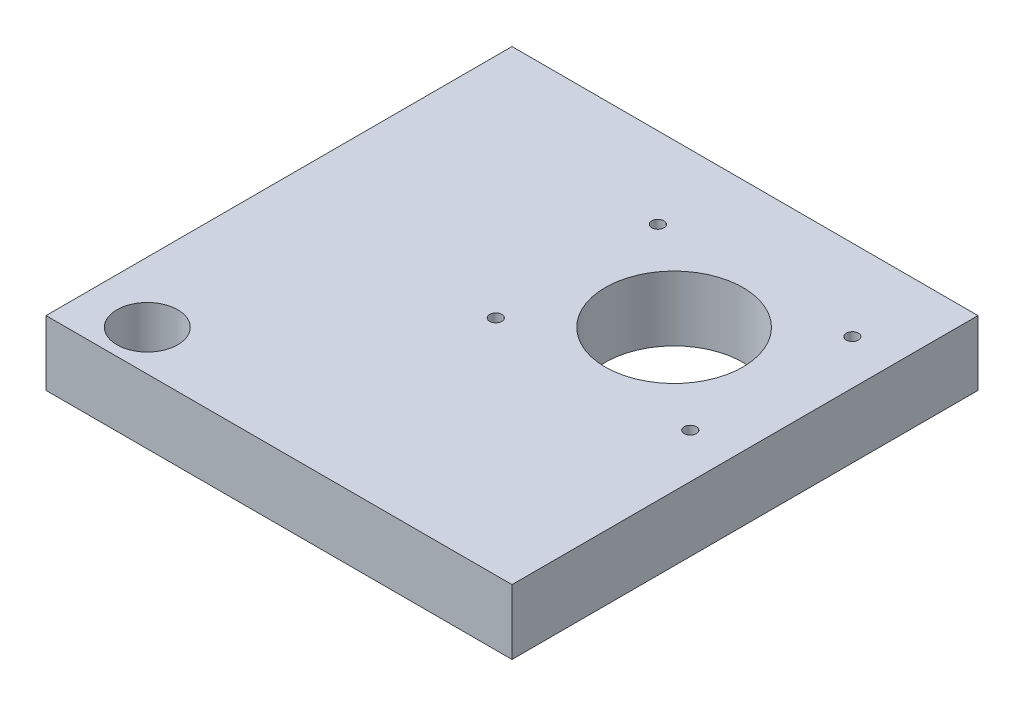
from build123d import *

# Parameters (mm, degrees)
ESQUISSE1_W             = 115
ESQUISSE1_H             = 16
BASE_EXTRUSION_DEPTH    = 115
ESQUISSE2_R             = 17
ENL_V_MAT_EXTRU_1_DEPTH = 164.419705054
ESQUISSE3_R             = 1.5
ENL_V_MAT_EXTRU_2_DEPTH = 164.419705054
ESQUISSE4_R             = 7.5
ENL_V_MAT_EXTRU_3_DEPTH = 164.419705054


with BuildPart() as part:
    # Esquisse1 → Base-Extrusion (new body)
    with BuildSketch(Plane.XY):
        with Locations((57.5, 8)):
            Rectangle(ESQUISSE1_W, ESQUISSE1_H)
    extrude(amount=BASE_EXTRUSION_DEPTH)

    # Esquisse2 → Enl_v. mat.-Extru.1 (cut, through all)
    with BuildSketch(Plane(origin=(0, 16, 0), x_dir=(-1, 0, 0), z_dir=(0, 1, 0))):
        with Locations(Location((-80, 40, 0), (0, 0, 90))):
            Circle(ESQUISSE2_R)
    extrude(amount=-ENL_V_MAT_EXTRU_1_DEPTH, mode=Mode.SUBTRACT)

    # Esquisse3 → Enl_v. mat.-Extru.2 (cut, through all)
    with BuildSketch(Plane(origin=(0, 16, 0), x_dir=(-1, 0, 0), z_dir=(0, 1, 0))):
        with Locations(Location((-104, 20, 0), (0, 0, 90))):
            Circle(ESQUISSE3_R)
        with Locations(Location((-104, 60, 0), (0, 0, 90))):
            Circle(ESQUISSE3_R)
        with Locations(Location((-56, 60, 0), (0, 0, 90))):
            Circle(ESQUISSE3_R)
        with Locations(Location((-56, 20, 0), (0, 0, 90))):
            Circle(ESQUISSE3_R)
    extrude(amount=-ENL_V_MAT_EXTRU_2_DEPTH, mode=Mode.SUBTRACT)

    # Esquisse4 → Enl_v. mat.-Extru.3 (cut, through all)
    with BuildSketch(Plane(origin=(0, 16, 0), x_dir=(-1, 0, 0), z_dir=(0, 1, 0))):
        with Locations(Location((-15, 105, 0), (0, 0, 90))):
            Circle(ESQUISSE4_R)
    extrude(amount=-ENL_V_MAT_EXTRU_3_DEPTH, mode=Mode.SUBTRACT)


solid = part.part
